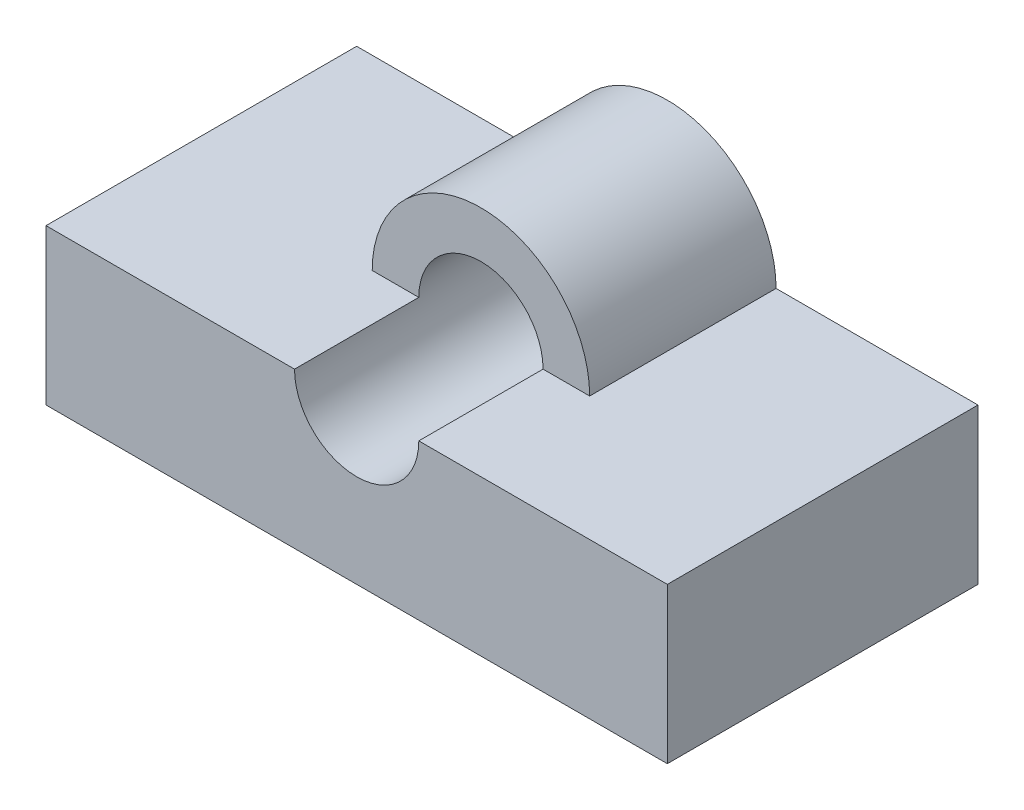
from build123d import *

# Parameters (mm, degrees)
EXTRUDE1_DEPTH = 50
EXTRUDE2_DEPTH = 30


with BuildPart() as part:
    # Sketch1 → Extrude1 (new body)
    with BuildSketch(Plane.XY):
        with BuildLine():
            Line((0, 25), (0, 0))
            Line((0, 0), (100, 0))
            Line((100, 0), (100, 25))
            Line((100, 25), (60, 25))
            ThreePointArc((60, 25), (50, 15), (40, 25))
            Line((40, 25), (0, 25))
        make_face()
    extrude(amount=EXTRUDE1_DEPTH)

    # Sketch1_3 → Extrude2 (add)
    with BuildSketch(Plane.XY):
        with BuildLine():
            ThreePointArc((67.5, 25), (50, 42.5), (32.5, 25))
            Line((32.5, 25), (40, 25))
            ThreePointArc((40, 25), (50, 35), (60, 25))
            Line((60, 25), (67.5, 25))
        make_face()
        with BuildLine():
            Line((40, 25), (32.5, 25))
            ThreePointArc((32.5, 25), (50, 7.5), (67.5, 25))
            Line((67.5, 25), (60, 25))
            ThreePointArc((60, 25), (50, 15), (40, 25))
        make_face()
    extrude(amount=EXTRUDE2_DEPTH)


solid = part.part
